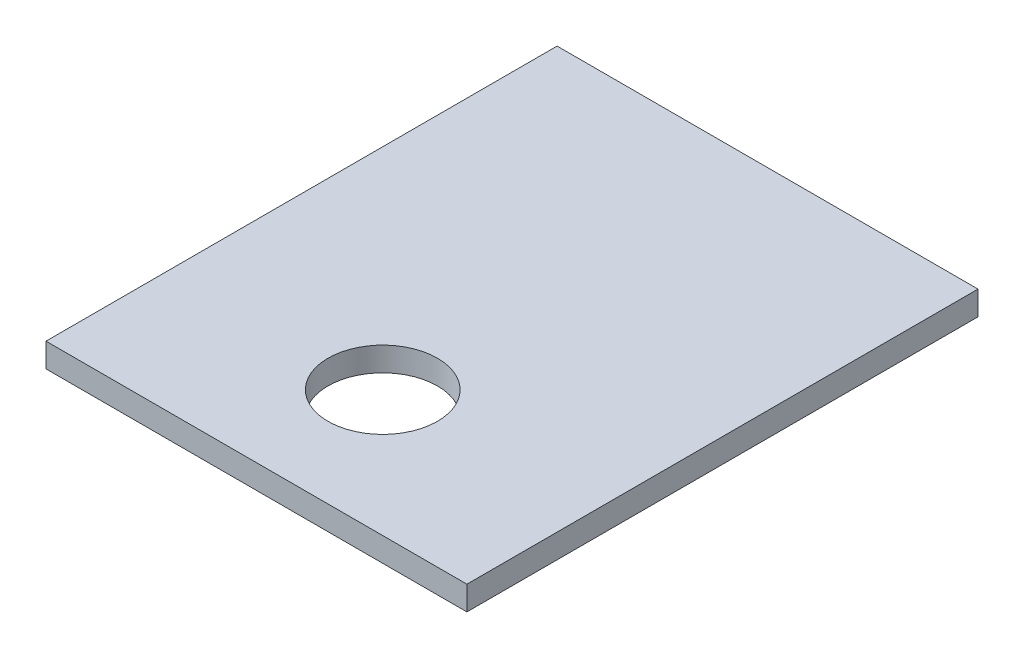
ISO-10303-21;
HEADER;
FILE_DESCRIPTION(('STEP AP214'),'2;1');
FILE_NAME('part.step','',(''),(''),'','','');
FILE_SCHEMA(('AUTOMOTIVE_DESIGN { 1 0 10303 214 1 1 1 1 }'));
ENDSEC;
DATA;
#1=APPLICATION_CONTEXT('core data for automotive mechanical design processes');
#2=APPLICATION_PROTOCOL_DEFINITION('international standard','automotive_design',2000,#1);
#3=PRODUCT_CONTEXT('',#1,'mechanical');
#4=PRODUCT('Part','Part','',(#3));
#5=PRODUCT_RELATED_PRODUCT_CATEGORY('part','',(#4));
#6=PRODUCT_DEFINITION_FORMATION('','',#4);
#7=PRODUCT_DEFINITION_CONTEXT('part definition',#1,'design');
#8=PRODUCT_DEFINITION('design','',#6,#7);
#9=PRODUCT_DEFINITION_SHAPE('','',#8);
#10=(LENGTH_UNIT() NAMED_UNIT(*) SI_UNIT(.MILLI.,.METRE.));
#11=(NAMED_UNIT(*) PLANE_ANGLE_UNIT() SI_UNIT($,.RADIAN.));
#12=(NAMED_UNIT(*) SI_UNIT($,.STERADIAN.) SOLID_ANGLE_UNIT());
#13=UNCERTAINTY_MEASURE_WITH_UNIT(LENGTH_MEASURE(1.E-05),#10,'distance_accuracy_value','');
#14=(GEOMETRIC_REPRESENTATION_CONTEXT(3) GLOBAL_UNCERTAINTY_ASSIGNED_CONTEXT((#13)) GLOBAL_UNIT_ASSIGNED_CONTEXT((#10,
#11,#12)) REPRESENTATION_CONTEXT('',''));
#15=CARTESIAN_POINT('',(0.,0.,0.));
#16=DIRECTION('',(0.,0.,1.));
#17=DIRECTION('',(1.,0.,0.));
#18=AXIS2_PLACEMENT_3D('',#15,#16,#17);
#19=CARTESIAN_POINT('',(0.9,5.300000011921,6.3));
#20=DIRECTION('',(0.,1.,0.));
#21=DIRECTION('',(0.,0.,1.));
#22=AXIS2_PLACEMENT_3D('',#19,#20,#21);
#23=PLANE('',#22);
#24=CARTESIAN_POINT('',(7.9,5.3,19.1));
#25=DIRECTION('',(0.,-1.,0.));
#26=DIRECTION('',(0.,0.,-1.));
#27=AXIS2_PLACEMENT_3D('',#24,#25,#26);
#28=CIRCLE('',#27,1.820000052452);
#29=CARTESIAN_POINT('',(7.9,5.3,17.279999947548));
#30=VERTEX_POINT('',#29);
#31=EDGE_CURVE('E19',#30,#30,#28,.T.);
#32=ORIENTED_EDGE('',*,*,#31,.T.);
#33=EDGE_LOOP('',(#32));
#34=FACE_BOUND('',#33,.T.);
#35=DIRECTION('',(1.,0.,0.));
#36=VECTOR('',#35,1.);
#37=CARTESIAN_POINT('',(0.9,5.300000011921,23.3));
#38=LINE('',#37,#36);
#39=CARTESIAN_POINT('',(14.9,5.300000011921,23.3));
#40=VERTEX_POINT('',#39);
#41=CARTESIAN_POINT('',(0.9,5.300000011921,23.3));
#42=VERTEX_POINT('',#41);
#43=EDGE_CURVE('E89',#40,#42,#38,.F.);
#44=ORIENTED_EDGE('',*,*,#43,.F.);
#45=DIRECTION('',(0.,0.,-1.));
#46=VECTOR('',#45,1.);
#47=CARTESIAN_POINT('',(14.9,5.300000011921,6.3));
#48=LINE('',#47,#46);
#49=CARTESIAN_POINT('',(14.9,5.300000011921,6.3));
#50=VERTEX_POINT('',#49);
#51=EDGE_CURVE('E58',#50,#40,#48,.F.);
#52=ORIENTED_EDGE('',*,*,#51,.F.);
#53=DIRECTION('',(1.,0.,0.));
#54=VECTOR('',#53,1.);
#55=CARTESIAN_POINT('',(0.9,5.300000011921,6.3));
#56=LINE('',#55,#54);
#57=CARTESIAN_POINT('',(0.9,5.300000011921,6.3));
#58=VERTEX_POINT('',#57);
#59=EDGE_CURVE('E57',#50,#58,#56,.F.);
#60=ORIENTED_EDGE('',*,*,#59,.T.);
#61=DIRECTION('',(0.,0.,-1.));
#62=VECTOR('',#61,1.);
#63=CARTESIAN_POINT('',(0.9,5.300000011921,6.3));
#64=LINE('',#63,#62);
#65=EDGE_CURVE('E54',#58,#42,#64,.F.);
#66=ORIENTED_EDGE('',*,*,#65,.T.);
#67=EDGE_LOOP('',(#44,#52,#60,#66));
#68=FACE_BOUND('',#67,.T.);
#69=ADVANCED_FACE('F16',(#34,#68),#23,.T.);
#70=CARTESIAN_POINT('',(7.9,5.3,19.1));
#71=DIRECTION('',(0.,-1.,0.));
#72=DIRECTION('',(0.,0.,-1.));
#73=AXIS2_PLACEMENT_3D('',#70,#71,#72);
#74=CYLINDRICAL_SURFACE('',#73,1.820000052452);
#75=CARTESIAN_POINT('',(7.9,4.5,19.1));
#76=DIRECTION('',(0.,-1.,0.));
#77=DIRECTION('',(0.,0.,-1.));
#78=AXIS2_PLACEMENT_3D('',#75,#76,#77);
#79=CIRCLE('',#78,1.820000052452);
#80=CARTESIAN_POINT('',(7.9,4.5,17.279999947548));
#81=VERTEX_POINT('',#80);
#82=EDGE_CURVE('E77',#81,#81,#79,.T.);
#83=ORIENTED_EDGE('',*,*,#82,.T.);
#84=EDGE_LOOP('',(#83));
#85=FACE_BOUND('',#84,.T.);
#86=ORIENTED_EDGE('',*,*,#31,.F.);
#87=EDGE_LOOP('',(#86));
#88=FACE_BOUND('',#87,.T.);
#89=ADVANCED_FACE('F112',(#85,#88),#74,.F.);
#90=CARTESIAN_POINT('',(0.9,4.5,6.3));
#91=DIRECTION('',(0.,0.,1.));
#92=DIRECTION('',(1.,0.,0.));
#93=AXIS2_PLACEMENT_3D('',#90,#91,#92);
#94=PLANE('',#93);
#95=DIRECTION('',(0.,1.,0.));
#96=VECTOR('',#95,1.);
#97=CARTESIAN_POINT('',(14.9,4.5,6.3));
#98=LINE('',#97,#96);
#99=CARTESIAN_POINT('',(14.9,4.5,6.3));
#100=VERTEX_POINT('',#99);
#101=EDGE_CURVE('E84',#100,#50,#98,.T.);
#102=ORIENTED_EDGE('',*,*,#101,.F.);
#103=DIRECTION('',(1.,0.,0.));
#104=VECTOR('',#103,1.);
#105=CARTESIAN_POINT('',(0.9,4.5,6.3));
#106=LINE('',#105,#104);
#107=CARTESIAN_POINT('',(0.9,4.5,6.3));
#108=VERTEX_POINT('',#107);
#109=EDGE_CURVE('E74',#100,#108,#106,.F.);
#110=ORIENTED_EDGE('',*,*,#109,.T.);
#111=DIRECTION('',(0.,1.,0.));
#112=VECTOR('',#111,1.);
#113=CARTESIAN_POINT('',(0.9,4.5,6.3));
#114=LINE('',#113,#112);
#115=EDGE_CURVE('E63',#108,#58,#114,.T.);
#116=ORIENTED_EDGE('',*,*,#115,.T.);
#117=ORIENTED_EDGE('',*,*,#59,.F.);
#118=EDGE_LOOP('',(#102,#110,#116,#117));
#119=FACE_BOUND('',#118,.T.);
#120=ADVANCED_FACE('F73',(#119),#94,.F.);
#121=CARTESIAN_POINT('',(0.9,4.5,6.3));
#122=DIRECTION('',(1.,0.,0.));
#123=DIRECTION('',(0.,0.,-1.));
#124=AXIS2_PLACEMENT_3D('',#121,#122,#123);
#125=PLANE('',#124);
#126=ORIENTED_EDGE('',*,*,#65,.F.);
#127=ORIENTED_EDGE('',*,*,#115,.F.);
#128=DIRECTION('',(0.,0.,1.));
#129=VECTOR('',#128,1.);
#130=CARTESIAN_POINT('',(0.9,4.5,6.3));
#131=LINE('',#130,#129);
#132=CARTESIAN_POINT('',(0.9,4.5,23.3));
#133=VERTEX_POINT('',#132);
#134=EDGE_CURVE('E81',#108,#133,#131,.T.);
#135=ORIENTED_EDGE('',*,*,#134,.T.);
#136=DIRECTION('',(0.,1.,0.));
#137=VECTOR('',#136,1.);
#138=CARTESIAN_POINT('',(0.9,4.5,23.3));
#139=LINE('',#138,#137);
#140=EDGE_CURVE('E70',#42,#133,#139,.F.);
#141=ORIENTED_EDGE('',*,*,#140,.F.);
#142=EDGE_LOOP('',(#126,#127,#135,#141));
#143=FACE_BOUND('',#142,.T.);
#144=ADVANCED_FACE('F67',(#143),#125,.F.);
#145=CARTESIAN_POINT('',(0.9,4.5,23.3));
#146=DIRECTION('',(0.,0.,1.));
#147=DIRECTION('',(1.,0.,0.));
#148=AXIS2_PLACEMENT_3D('',#145,#146,#147);
#149=PLANE('',#148);
#150=DIRECTION('',(0.,1.,0.));
#151=VECTOR('',#150,1.);
#152=CARTESIAN_POINT('',(14.9,4.5,23.3));
#153=LINE('',#152,#151);
#154=CARTESIAN_POINT('',(14.9,4.5,23.3));
#155=VERTEX_POINT('',#154);
#156=EDGE_CURVE('E33',#40,#155,#153,.F.);
#157=ORIENTED_EDGE('',*,*,#156,.F.);
#158=ORIENTED_EDGE('',*,*,#43,.T.);
#159=ORIENTED_EDGE('',*,*,#140,.T.);
#160=DIRECTION('',(1.,0.,0.));
#161=VECTOR('',#160,1.);
#162=CARTESIAN_POINT('',(0.9,4.5,23.3));
#163=LINE('',#162,#161);
#164=EDGE_CURVE('E25',#133,#155,#163,.T.);
#165=ORIENTED_EDGE('',*,*,#164,.T.);
#166=EDGE_LOOP('',(#157,#158,#159,#165));
#167=FACE_BOUND('',#166,.T.);
#168=ADVANCED_FACE('F93',(#167),#149,.T.);
#169=CARTESIAN_POINT('',(14.9,4.5,6.3));
#170=DIRECTION('',(1.,0.,0.));
#171=DIRECTION('',(0.,0.,-1.));
#172=AXIS2_PLACEMENT_3D('',#169,#170,#171);
#173=PLANE('',#172);
#174=ORIENTED_EDGE('',*,*,#51,.T.);
#175=ORIENTED_EDGE('',*,*,#156,.T.);
#176=DIRECTION('',(0.,0.,1.));
#177=VECTOR('',#176,1.);
#178=CARTESIAN_POINT('',(14.9,4.5,6.3));
#179=LINE('',#178,#177);
#180=EDGE_CURVE('E10',#155,#100,#179,.F.);
#181=ORIENTED_EDGE('',*,*,#180,.T.);
#182=ORIENTED_EDGE('',*,*,#101,.T.);
#183=EDGE_LOOP('',(#174,#175,#181,#182));
#184=FACE_BOUND('',#183,.T.);
#185=ADVANCED_FACE('F98',(#184),#173,.T.);
#186=CARTESIAN_POINT('',(0.9,4.5,6.3));
#187=DIRECTION('',(0.,1.,0.));
#188=DIRECTION('',(0.,0.,1.));
#189=AXIS2_PLACEMENT_3D('',#186,#187,#188);
#190=PLANE('',#189);
#191=ORIENTED_EDGE('',*,*,#164,.F.);
#192=ORIENTED_EDGE('',*,*,#134,.F.);
#193=ORIENTED_EDGE('',*,*,#109,.F.);
#194=ORIENTED_EDGE('',*,*,#180,.F.);
#195=EDGE_LOOP('',(#191,#192,#193,#194));
#196=FACE_BOUND('',#195,.T.);
#197=ORIENTED_EDGE('',*,*,#82,.F.);
#198=EDGE_LOOP('',(#197));
#199=FACE_BOUND('',#198,.T.);
#200=ADVANCED_FACE('F95',(#196,#199),#190,.F.);
#201=CLOSED_SHELL('',(#69,#89,#120,#144,#168,#185,#200));
#202=MANIFOLD_SOLID_BREP('B1',#201);
#203=ADVANCED_BREP_SHAPE_REPRESENTATION('',(#18,#202),#14);
#204=SHAPE_DEFINITION_REPRESENTATION(#9,#203);
ENDSEC;
END-ISO-10303-21;
